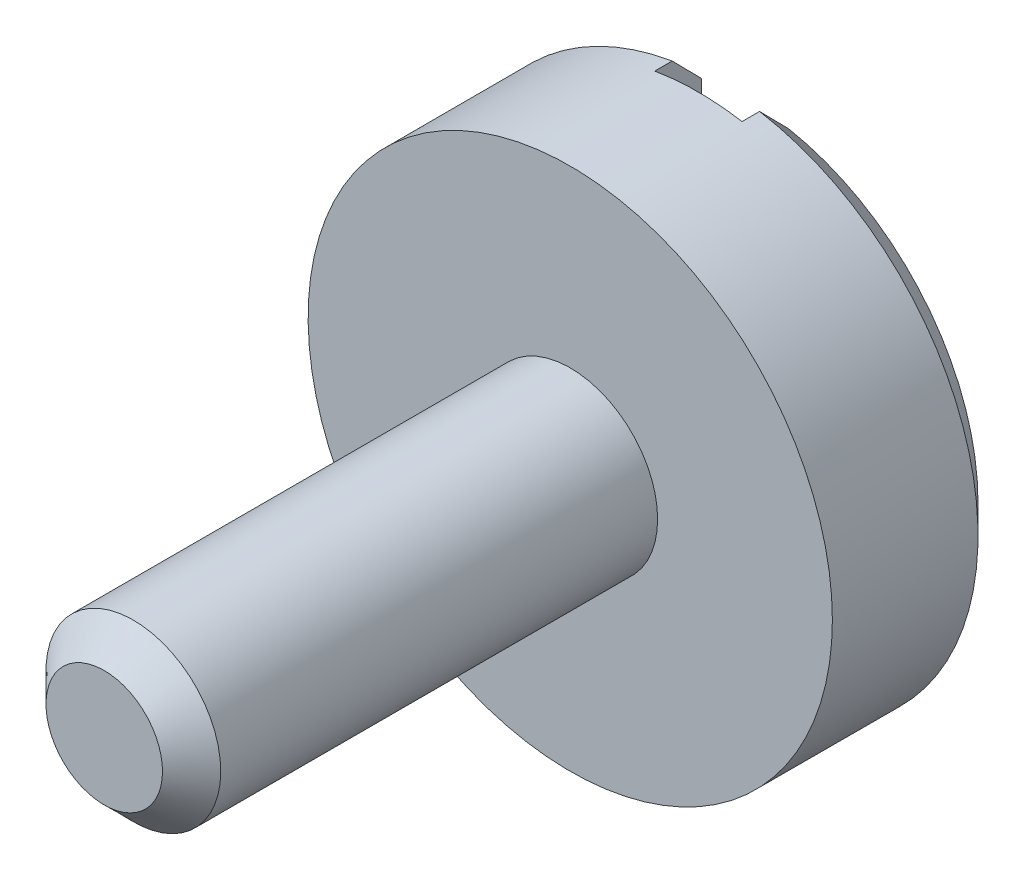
ISO-10303-21;
HEADER;
FILE_DESCRIPTION(('STEP AP214'),'2;1');
FILE_NAME('part.step','',(''),(''),'','','');
FILE_SCHEMA(('AUTOMOTIVE_DESIGN { 1 0 10303 214 1 1 1 1 }'));
ENDSEC;
DATA;
#1=APPLICATION_CONTEXT('core data for automotive mechanical design processes');
#2=APPLICATION_PROTOCOL_DEFINITION('international standard','automotive_design',2000,#1);
#3=PRODUCT_CONTEXT('',#1,'mechanical');
#4=PRODUCT('Part','Part','',(#3));
#5=PRODUCT_RELATED_PRODUCT_CATEGORY('part','',(#4));
#6=PRODUCT_DEFINITION_FORMATION('','',#4);
#7=PRODUCT_DEFINITION_CONTEXT('part definition',#1,'design');
#8=PRODUCT_DEFINITION('design','',#6,#7);
#9=PRODUCT_DEFINITION_SHAPE('','',#8);
#10=(LENGTH_UNIT() NAMED_UNIT(*) SI_UNIT(.MILLI.,.METRE.));
#11=(NAMED_UNIT(*) PLANE_ANGLE_UNIT() SI_UNIT($,.RADIAN.));
#12=(NAMED_UNIT(*) SI_UNIT($,.STERADIAN.) SOLID_ANGLE_UNIT());
#13=UNCERTAINTY_MEASURE_WITH_UNIT(LENGTH_MEASURE(1.E-05),#10,'distance_accuracy_value','');
#14=(GEOMETRIC_REPRESENTATION_CONTEXT(3) GLOBAL_UNCERTAINTY_ASSIGNED_CONTEXT((#13)) GLOBAL_UNIT_ASSIGNED_CONTEXT((#10,
#11,#12)) REPRESENTATION_CONTEXT('',''));
#15=CARTESIAN_POINT('',(0.,0.,0.));
#16=DIRECTION('',(0.,0.,1.));
#17=DIRECTION('',(1.,0.,0.));
#18=AXIS2_PLACEMENT_3D('',#15,#16,#17);
#19=CARTESIAN_POINT('',(0.,0.,0.));
#20=DIRECTION('',(0.,0.,1.));
#21=DIRECTION('',(1.,0.,0.));
#22=AXIS2_PLACEMENT_3D('',#19,#20,#21);
#23=PLANE('',#22);
#24=CARTESIAN_POINT('',(0.,0.,0.));
#25=DIRECTION('',(0.,0.,1.));
#26=DIRECTION('',(1.,0.,0.));
#27=AXIS2_PLACEMENT_3D('',#24,#25,#26);
#28=CIRCLE('',#27,4.);
#29=CARTESIAN_POINT('',(0.75,3.92905841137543,0.));
#30=VERTEX_POINT('',#29);
#31=CARTESIAN_POINT('',(0.75,-3.92905841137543,0.));
#32=VERTEX_POINT('',#31);
#33=EDGE_CURVE('E92',#30,#32,#28,.F.);
#34=ORIENTED_EDGE('',*,*,#33,.T.);
#35=DIRECTION('',(0.,-1.,0.));
#36=VECTOR('',#35,1.);
#37=CARTESIAN_POINT('',(0.750000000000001,4.82400000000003,0.));
#38=LINE('',#37,#36);
#39=EDGE_CURVE('E81',#30,#32,#38,.T.);
#40=ORIENTED_EDGE('',*,*,#39,.F.);
#41=EDGE_LOOP('',(#34,#40));
#42=FACE_BOUND('',#41,.T.);
#43=ADVANCED_FACE('F27',(#42),#23,.F.);
#44=CARTESIAN_POINT('',(0.,0.,0.5));
#45=DIRECTION('',(0.,0.,1.));
#46=DIRECTION('',(1.,0.,0.));
#47=AXIS2_PLACEMENT_3D('',#44,#45,#46);
#48=CONICAL_SURFACE('',#47,4.5,0.785398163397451);
#49=CARTESIAN_POINT('',(0.750000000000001,9.8801014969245,5.90852691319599));
#50=CARTESIAN_POINT('',(0.750000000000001,9.53013802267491,5.55957617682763));
#51=CARTESIAN_POINT('',(0.750000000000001,9.18012968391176,5.21067039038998));
#52=CARTESIAN_POINT('',(0.750000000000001,8.47994963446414,4.51299744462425));
#53=CARTESIAN_POINT('',(0.750000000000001,8.12977791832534,4.16423029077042));
#54=CARTESIAN_POINT('',(0.750000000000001,7.42891449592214,3.46660172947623));
#55=CARTESIAN_POINT('',(0.750000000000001,7.07822260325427,3.11774050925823));
#56=CARTESIAN_POINT('',(0.750000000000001,6.37652299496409,2.42036050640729));
#57=CARTESIAN_POINT('',(0.750000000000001,6.02551529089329,2.07184171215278));
#58=CARTESIAN_POINT('',(0.750000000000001,5.3382456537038,1.39049062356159));
#59=CARTESIAN_POINT('',(0.750000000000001,5.00200644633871,1.05763542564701));
#60=CARTESIAN_POINT('',(0.750000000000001,4.4969680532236,0.559004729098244));
#61=CARTESIAN_POINT('',(0.75,4.32849963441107,0.392894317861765));
#62=CARTESIAN_POINT('',(0.75,3.99125014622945,0.0609945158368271));
#63=CARTESIAN_POINT('',(0.75,3.82246908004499,-0.104794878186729));
#64=CARTESIAN_POINT('',(0.75,3.48454245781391,-0.435820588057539));
#65=CARTESIAN_POINT('',(0.75,3.31539714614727,-0.601057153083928));
#66=CARTESIAN_POINT('',(0.75,2.97639753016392,-0.930814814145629));
#67=CARTESIAN_POINT('',(0.75,2.80654319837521,-1.09533588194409));
#68=CARTESIAN_POINT('',(0.75,2.46572504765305,-1.42316683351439));
#69=CARTESIAN_POINT('',(0.75,2.29476144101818,-1.58647693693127));
#70=CARTESIAN_POINT('',(0.75,2.03673116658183,-1.82975198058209));
#71=CARTESIAN_POINT('',(0.75,1.95045964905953,-1.91055948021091));
#72=CARTESIAN_POINT('',(0.75,1.77714992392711,-2.07134729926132));
#73=CARTESIAN_POINT('',(0.75,1.69011173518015,-2.15132763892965));
#74=CARTESIAN_POINT('',(0.75,1.5781739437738,-2.25270808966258));
#75=CARTESIAN_POINT('',(0.75,1.55380285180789,-2.27469188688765));
#76=CARTESIAN_POINT('',(0.75,1.50495911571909,-2.31854648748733));
#77=CARTESIAN_POINT('',(0.75,1.48048647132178,-2.34041729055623));
#78=CARTESIAN_POINT('',(0.75,1.40689272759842,-2.40584164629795));
#79=CARTESIAN_POINT('',(0.75,1.35760030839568,-2.44920306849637));
#80=CARTESIAN_POINT('',(0.75,1.25806979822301,-2.53554734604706));
#81=CARTESIAN_POINT('',(0.75,1.20782748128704,-2.57852534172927));
#82=CARTESIAN_POINT('',(0.75,1.10655031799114,-2.66351443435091));
#83=CARTESIAN_POINT('',(0.75,1.05551568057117,-2.70552577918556));
#84=CARTESIAN_POINT('',(0.75,0.951926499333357,-2.78851652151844));
#85=CARTESIAN_POINT('',(0.75,0.899362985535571,-2.82948478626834));
#86=CARTESIAN_POINT('',(0.75,0.792671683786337,-2.90932497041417));
#87=CARTESIAN_POINT('',(0.75,0.738544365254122,-2.94819750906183));
#88=CARTESIAN_POINT('',(0.75,0.628343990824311,-3.02242233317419));
#89=CARTESIAN_POINT('',(0.75,0.572283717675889,-3.05779334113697));
#90=CARTESIAN_POINT('',(0.75,0.457074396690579,-3.12298205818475));
#91=CARTESIAN_POINT('',(0.75,0.397934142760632,-3.15281457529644));
#92=CARTESIAN_POINT('',(0.75,0.290865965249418,-3.19665689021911));
#93=CARTESIAN_POINT('',(0.75,0.243824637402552,-3.21275750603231));
#94=CARTESIAN_POINT('',(0.75,0.147803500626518,-3.23696114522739));
#95=CARTESIAN_POINT('',(0.75,0.0988338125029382,-3.24510130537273));
#96=CARTESIAN_POINT('',(0.75,0.0246847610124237,-3.25001161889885));
#97=CARTESIAN_POINT('',(0.75,-0.000280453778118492,-3.25041424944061));
#98=CARTESIAN_POINT('',(0.75,-0.0501267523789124,-3.24873902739));
#99=CARTESIAN_POINT('',(0.75,-0.0750078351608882,-3.24666114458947));
#100=CARTESIAN_POINT('',(0.75,-0.149305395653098,-3.23685543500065));
#101=CARTESIAN_POINT('',(0.75,-0.198267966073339,-3.22554920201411));
#102=CARTESIAN_POINT('',(0.75,-0.282094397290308,-3.1994472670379));
#103=CARTESIAN_POINT('',(0.75,-0.317476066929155,-3.1861827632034));
#104=CARTESIAN_POINT('',(0.75,-0.386977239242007,-3.15663454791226));
#105=CARTESIAN_POINT('',(0.75,-0.421095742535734,-3.14034850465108));
#106=CARTESIAN_POINT('',(0.75,-0.488327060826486,-3.1054993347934));
#107=CARTESIAN_POINT('',(0.75,-0.52143450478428,-3.08692604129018));
#108=CARTESIAN_POINT('',(0.75,-0.586663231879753,-3.0481662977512));
#109=CARTESIAN_POINT('',(0.75,-0.618784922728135,-3.02798052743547));
#110=CARTESIAN_POINT('',(0.75,-0.688343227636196,-2.98240590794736));
#111=CARTESIAN_POINT('',(0.75,-0.725612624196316,-2.95676348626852));
#112=CARTESIAN_POINT('',(0.75,-0.79927554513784,-2.9042451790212));
#113=CARTESIAN_POINT('',(0.75,-0.835668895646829,-2.87736905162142));
#114=CARTESIAN_POINT('',(0.75,-0.943875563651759,-2.7953574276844));
#115=CARTESIAN_POINT('',(0.75,-1.01466377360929,-2.7388739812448));
#116=CARTESIAN_POINT('',(0.75,-1.15468028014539,-2.62369284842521));
#117=CARTESIAN_POINT('',(0.75,-1.22390430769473,-2.56499005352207));
#118=CARTESIAN_POINT('',(0.75,-1.36116263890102,-2.44626922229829));
#119=CARTESIAN_POINT('',(0.75,-1.42919741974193,-2.38625173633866));
#120=CARTESIAN_POINT('',(0.75,-1.56459377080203,-2.26519847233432));
#121=CARTESIAN_POINT('',(0.75,-1.63195374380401,-2.20416091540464));
#122=CARTESIAN_POINT('',(0.75,-1.76609640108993,-2.08144212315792));
#123=CARTESIAN_POINT('',(0.75,-1.83287902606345,-2.01976082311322));
#124=CARTESIAN_POINT('',(0.75,-1.96590720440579,-1.89602850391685));
#125=CARTESIAN_POINT('',(0.75,-2.03215343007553,-1.83397820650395));
#126=CARTESIAN_POINT('',(0.75,-2.16431283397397,-1.70952887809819));
#127=CARTESIAN_POINT('',(0.75,-2.2302260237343,-1.64712985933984));
#128=CARTESIAN_POINT('',(0.75,-2.42635813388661,-1.46069682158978));
#129=CARTESIAN_POINT('',(0.75,-2.55620491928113,-1.33627147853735));
#130=CARTESIAN_POINT('',(0.75,-2.8152586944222,-1.08675610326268));
#131=CARTESIAN_POINT('',(0.75,-2.9444656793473,-0.961666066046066));
#132=CARTESIAN_POINT('',(0.749999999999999,-3.33145178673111,-0.585726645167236));
#133=CARTESIAN_POINT('',(0.749999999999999,-3.5885879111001,-0.334215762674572));
#134=CARTESIAN_POINT('',(0.749999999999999,-4.10213893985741,0.169857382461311));
#135=CARTESIAN_POINT('',(0.749999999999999,-4.35855329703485,0.422420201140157));
#136=CARTESIAN_POINT('',(0.749999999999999,-4.87084762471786,0.928079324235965));
#137=CARTESIAN_POINT('',(0.749999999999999,-5.12672760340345,1.18117562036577));
#138=CARTESIAN_POINT('',(0.749999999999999,-5.6375360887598,1.68709805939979));
#139=CARTESIAN_POINT('',(0.749999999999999,-5.89246540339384,1.93992338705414));
#140=CARTESIAN_POINT('',(0.749999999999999,-6.40209695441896,2.44580483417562));
#141=CARTESIAN_POINT('',(0.749999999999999,-6.65679918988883,2.69886095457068));
#142=CARTESIAN_POINT('',(0.749999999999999,-7.42058711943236,3.45818728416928));
#143=CARTESIAN_POINT('',(0.749999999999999,-7.92943546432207,3.96469621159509));
#144=CARTESIAN_POINT('',(0.749999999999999,-8.55826367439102,4.59105769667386));
#145=CARTESIAN_POINT('',(0.749999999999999,-8.67840568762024,4.71074758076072));
#146=CARTESIAN_POINT('',(0.749999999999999,-8.91867488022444,4.95014833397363));
#147=CARTESIAN_POINT('',(0.749999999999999,-9.03880205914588,5.06985920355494));
#148=CARTESIAN_POINT('',(0.749999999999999,-9.27913419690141,5.30938965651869));
#149=CARTESIAN_POINT('',(0.749999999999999,-9.39933914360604,5.42920925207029));
#150=CARTESIAN_POINT('',(0.749999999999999,-9.63973196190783,5.668859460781));
#151=CARTESIAN_POINT('',(0.749999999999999,-9.75991983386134,5.78869007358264));
#152=CARTESIAN_POINT('',(0.749999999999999,-9.8801014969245,5.90852691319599));
#153=B_SPLINE_CURVE_WITH_KNOTS('',3,(#49,#50,#51,#52,#53,#54,#55,#56,#57,#58,#59,#60,#61,#62,
#63,#64,#65,#66,#67,#68,#69,#70,#71,#72,#73,#74,#75,#76,#77,#78,#79,#80,#81,#82,#83,#84,#85,#86,
#87,#88,#89,#90,#91,#92,#93,#94,#95,#96,#97,#98,#99,#100,#101,#102,#103,#104,#105,#106,#107,
#108,#109,#110,#111,#112,#113,#114,#115,#116,#117,#118,#119,#120,#121,#122,#123,#124,#125,#126,
#127,#128,#129,#130,#131,#132,#133,#134,#135,#136,#137,#138,#139,#140,#141,#142,#143,#144,#145,
#146,#147,#148,#149,#150,#151,#152),.UNSPECIFIED.,.F.,.F.,(4,2,2,2,2,2,2,2,2,2,2,2,2,2,2,2,2,2,
2,2,2,2,2,2,2,2,2,2,2,2,2,2,2,2,2,2,2,2,2,2,2,2,2,2,2,2,2,2,2,2,2,4),(0.,1.48262253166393,
2.96529872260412,4.44927989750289,5.93320883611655,7.35258945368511,8.0623556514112,
8.77211465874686,9.48149255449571,10.1908981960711,10.9001718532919,11.2547865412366,
11.6093925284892,11.7078561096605,11.8063199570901,12.0032658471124,12.2016072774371,
12.3998972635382,12.5997954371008,12.7996342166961,12.9983391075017,13.1965048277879,
13.3452003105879,13.4931987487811,13.5679885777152,13.6427793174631,13.7926802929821,
13.9058950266,14.019197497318,14.1330231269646,14.246801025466,14.3824816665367,
14.5181890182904,14.7897913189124,15.0620622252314,15.3342212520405,15.6069184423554,
15.879643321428,16.1519452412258,16.4242376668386,16.9637484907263,17.5032633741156,
18.5823270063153,19.6620609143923,20.7417781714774,21.8188975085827,22.8960211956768,
25.0499245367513,25.5586857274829,26.0674598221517,26.5766294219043,27.0857860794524),.UNSPECIFIED.);
#154=CARTESIAN_POINT('',(0.750000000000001,4.43705983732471,0.5));
#155=VERTEX_POINT('',#154);
#156=EDGE_CURVE('E78',#155,#30,#153,.T.);
#157=ORIENTED_EDGE('',*,*,#156,.F.);
#158=CARTESIAN_POINT('',(0.,0.,0.5));
#159=DIRECTION('',(0.,0.,1.));
#160=DIRECTION('',(1.,0.,0.));
#161=AXIS2_PLACEMENT_3D('',#158,#159,#160);
#162=CIRCLE('',#161,4.5);
#163=CARTESIAN_POINT('',(0.749999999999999,-4.43705983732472,0.500000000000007));
#164=VERTEX_POINT('',#163);
#165=EDGE_CURVE('E101',#164,#155,#162,.T.);
#166=ORIENTED_EDGE('',*,*,#165,.F.);
#167=EDGE_CURVE('E88',#32,#164,#153,.T.);
#168=ORIENTED_EDGE('',*,*,#167,.F.);
#169=ORIENTED_EDGE('',*,*,#33,.F.);
#170=EDGE_LOOP('',(#157,#166,#168,#169));
#171=FACE_BOUND('',#170,.T.);
#172=ADVANCED_FACE('F94',(#171),#48,.T.);
#173=CARTESIAN_POINT('',(0.,0.,3.));
#174=DIRECTION('',(0.,0.,1.));
#175=DIRECTION('',(1.,0.,0.));
#176=AXIS2_PLACEMENT_3D('',#173,#174,#175);
#177=PLANE('',#176);
#178=CARTESIAN_POINT('',(0.,0.,3.));
#179=DIRECTION('',(0.,0.,1.));
#180=DIRECTION('',(1.,0.,0.));
#181=AXIS2_PLACEMENT_3D('',#178,#179,#180);
#182=CIRCLE('',#181,4.5);
#183=CARTESIAN_POINT('',(4.5,0.,3.));
#184=VERTEX_POINT('',#183);
#185=EDGE_CURVE('E178',#184,#184,#182,.T.);
#186=ORIENTED_EDGE('',*,*,#185,.T.);
#187=EDGE_LOOP('',(#186));
#188=FACE_BOUND('',#187,.T.);
#189=CARTESIAN_POINT('',(0.,0.,3.));
#190=DIRECTION('',(0.,0.,1.));
#191=DIRECTION('',(1.,0.,0.));
#192=AXIS2_PLACEMENT_3D('',#189,#190,#191);
#193=CIRCLE('',#192,1.5);
#194=CARTESIAN_POINT('',(1.5,0.,3.));
#195=VERTEX_POINT('',#194);
#196=EDGE_CURVE('E176',#195,#195,#193,.T.);
#197=ORIENTED_EDGE('',*,*,#196,.F.);
#198=EDGE_LOOP('',(#197));
#199=FACE_BOUND('',#198,.T.);
#200=ADVANCED_FACE('F139',(#188,#199),#177,.T.);
#201=CARTESIAN_POINT('',(0.,0.,3.));
#202=DIRECTION('',(0.,0.,-1.));
#203=DIRECTION('',(-1.,0.,0.));
#204=AXIS2_PLACEMENT_3D('',#201,#202,#203);
#205=CYLINDRICAL_SURFACE('',#204,4.5);
#206=ORIENTED_EDGE('',*,*,#165,.T.);
#207=DIRECTION('',(0.,0.,-1.));
#208=VECTOR('',#207,1.);
#209=CARTESIAN_POINT('',(0.750000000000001,4.43705983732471,3.));
#210=LINE('',#209,#208);
#211=CARTESIAN_POINT('',(0.750000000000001,4.43705983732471,0.8));
#212=VERTEX_POINT('',#211);
#213=EDGE_CURVE('E50',#155,#212,#210,.F.);
#214=ORIENTED_EDGE('',*,*,#213,.T.);
#215=CARTESIAN_POINT('',(0.,0.,0.8));
#216=DIRECTION('',(0.,0.,-1.));
#217=DIRECTION('',(-1.,0.,0.));
#218=AXIS2_PLACEMENT_3D('',#215,#216,#217);
#219=CIRCLE('',#218,4.5);
#220=CARTESIAN_POINT('',(-0.749999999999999,4.43705983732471,0.8));
#221=VERTEX_POINT('',#220);
#222=EDGE_CURVE('E163',#221,#212,#219,.T.);
#223=ORIENTED_EDGE('',*,*,#222,.F.);
#224=DIRECTION('',(0.,0.,-1.));
#225=VECTOR('',#224,1.);
#226=CARTESIAN_POINT('',(-0.749999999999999,4.43705983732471,3.));
#227=LINE('',#226,#225);
#228=CARTESIAN_POINT('',(-0.749999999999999,4.43705983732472,0.500000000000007));
#229=VERTEX_POINT('',#228);
#230=EDGE_CURVE('E158',#221,#229,#227,.T.);
#231=ORIENTED_EDGE('',*,*,#230,.T.);
#232=CARTESIAN_POINT('',(-0.750000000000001,-4.43705983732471,0.5));
#233=VERTEX_POINT('',#232);
#234=EDGE_CURVE('E96',#229,#233,#162,.T.);
#235=ORIENTED_EDGE('',*,*,#234,.T.);
#236=DIRECTION('',(0.,0.,-1.));
#237=VECTOR('',#236,1.);
#238=CARTESIAN_POINT('',(-0.750000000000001,-4.43705983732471,3.));
#239=LINE('',#238,#237);
#240=CARTESIAN_POINT('',(-0.750000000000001,-4.43705983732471,0.8));
#241=VERTEX_POINT('',#240);
#242=EDGE_CURVE('E164',#233,#241,#239,.F.);
#243=ORIENTED_EDGE('',*,*,#242,.T.);
#244=CARTESIAN_POINT('',(0.749999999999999,-4.43705983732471,0.8));
#245=VERTEX_POINT('',#244);
#246=EDGE_CURVE('E87',#245,#241,#219,.T.);
#247=ORIENTED_EDGE('',*,*,#246,.F.);
#248=DIRECTION('',(0.,0.,-1.));
#249=VECTOR('',#248,1.);
#250=CARTESIAN_POINT('',(0.749999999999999,-4.43705983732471,3.));
#251=LINE('',#250,#249);
#252=EDGE_CURVE('E167',#245,#164,#251,.T.);
#253=ORIENTED_EDGE('',*,*,#252,.T.);
#254=EDGE_LOOP('',(#206,#214,#223,#231,#235,#243,#247,#253));
#255=FACE_BOUND('',#254,.T.);
#256=ORIENTED_EDGE('',*,*,#185,.F.);
#257=EDGE_LOOP('',(#256));
#258=FACE_BOUND('',#257,.T.);
#259=ADVANCED_FACE('F29',(#255,#258),#205,.T.);
#260=CARTESIAN_POINT('',(-0.750000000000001,-3.92905841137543,0.));
#261=VERTEX_POINT('',#260);
#262=CARTESIAN_POINT('',(-0.749999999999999,3.92905841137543,0.));
#263=VERTEX_POINT('',#262);
#264=EDGE_CURVE('E95',#261,#263,#28,.F.);
#265=ORIENTED_EDGE('',*,*,#264,.T.);
#266=DIRECTION('',(0.,1.,0.));
#267=VECTOR('',#266,1.);
#268=CARTESIAN_POINT('',(-0.749999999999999,4.82400000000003,0.));
#269=LINE('',#268,#267);
#270=EDGE_CURVE('E42',#261,#263,#269,.T.);
#271=ORIENTED_EDGE('',*,*,#270,.F.);
#272=EDGE_LOOP('',(#265,#271));
#273=FACE_BOUND('',#272,.T.);
#274=ADVANCED_FACE('F134',(#273),#23,.F.);
#275=CARTESIAN_POINT('',(0.,0.,11.));
#276=DIRECTION('',(0.,0.,-1.));
#277=DIRECTION('',(-1.,0.,0.));
#278=AXIS2_PLACEMENT_3D('',#275,#276,#277);
#279=CYLINDRICAL_SURFACE('',#278,1.5);
#280=CARTESIAN_POINT('',(0.,0.,10.5));
#281=DIRECTION('',(0.,0.,1.));
#282=DIRECTION('',(1.,0.,0.));
#283=AXIS2_PLACEMENT_3D('',#280,#281,#282);
#284=CIRCLE('',#283,1.5);
#285=CARTESIAN_POINT('',(1.5,0.,10.5));
#286=VERTEX_POINT('',#285);
#287=EDGE_CURVE('E11',#286,#286,#284,.F.);
#288=ORIENTED_EDGE('',*,*,#287,.T.);
#289=EDGE_LOOP('',(#288));
#290=FACE_BOUND('',#289,.T.);
#291=ORIENTED_EDGE('',*,*,#196,.T.);
#292=EDGE_LOOP('',(#291));
#293=FACE_BOUND('',#292,.T.);
#294=ADVANCED_FACE('F142',(#290,#293),#279,.T.);
#295=CARTESIAN_POINT('',(0.,0.,11.));
#296=DIRECTION('',(0.,0.,1.));
#297=DIRECTION('',(1.,0.,0.));
#298=AXIS2_PLACEMENT_3D('',#295,#296,#297);
#299=PLANE('',#298);
#300=CARTESIAN_POINT('',(0.,0.,11.));
#301=DIRECTION('',(0.,0.,1.));
#302=DIRECTION('',(1.,0.,0.));
#303=AXIS2_PLACEMENT_3D('',#300,#301,#302);
#304=CIRCLE('',#303,1.);
#305=CARTESIAN_POINT('',(1.,0.,11.));
#306=VERTEX_POINT('',#305);
#307=EDGE_CURVE('E35',#306,#306,#304,.T.);
#308=ORIENTED_EDGE('',*,*,#307,.T.);
#309=EDGE_LOOP('',(#308));
#310=FACE_BOUND('',#309,.T.);
#311=ADVANCED_FACE('F149',(#310),#299,.T.);
#312=CARTESIAN_POINT('',(-0.750000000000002,-9.8801014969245,5.90852691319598));
#313=CARTESIAN_POINT('',(-0.750000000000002,-9.53013802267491,5.55957617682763));
#314=CARTESIAN_POINT('',(-0.750000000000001,-9.18012968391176,5.21067039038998));
#315=CARTESIAN_POINT('',(-0.750000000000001,-8.47994963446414,4.51299744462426));
#316=CARTESIAN_POINT('',(-0.750000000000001,-8.12977791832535,4.16423029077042));
#317=CARTESIAN_POINT('',(-0.750000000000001,-7.42891449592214,3.46660172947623));
#318=CARTESIAN_POINT('',(-0.750000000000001,-7.07822260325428,3.11774050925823));
#319=CARTESIAN_POINT('',(-0.750000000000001,-6.37652299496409,2.4203605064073));
#320=CARTESIAN_POINT('',(-0.750000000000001,-6.0255152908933,2.07184171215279));
#321=CARTESIAN_POINT('',(-0.750000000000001,-5.33824565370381,1.39049062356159));
#322=CARTESIAN_POINT('',(-0.750000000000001,-5.00200644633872,1.05763542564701));
#323=CARTESIAN_POINT('',(-0.750000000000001,-4.4969680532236,0.559004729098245));
#324=CARTESIAN_POINT('',(-0.750000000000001,-4.32849963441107,0.392894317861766));
#325=CARTESIAN_POINT('',(-0.750000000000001,-3.99125014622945,0.0609945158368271));
#326=CARTESIAN_POINT('',(-0.750000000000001,-3.82246908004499,-0.104794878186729));
#327=CARTESIAN_POINT('',(-0.750000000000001,-3.48454245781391,-0.435820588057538));
#328=CARTESIAN_POINT('',(-0.750000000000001,-3.31539714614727,-0.601057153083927));
#329=CARTESIAN_POINT('',(-0.750000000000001,-2.97639753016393,-0.930814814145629));
#330=CARTESIAN_POINT('',(-0.750000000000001,-2.80654319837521,-1.09533588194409));
#331=CARTESIAN_POINT('',(-0.750000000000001,-2.46572504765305,-1.42316683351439));
#332=CARTESIAN_POINT('',(-0.75,-2.29476144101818,-1.58647693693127));
#333=CARTESIAN_POINT('',(-0.75,-2.03673116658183,-1.82975198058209));
#334=CARTESIAN_POINT('',(-0.75,-1.95045964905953,-1.91055948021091));
#335=CARTESIAN_POINT('',(-0.75,-1.77714992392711,-2.07134729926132));
#336=CARTESIAN_POINT('',(-0.75,-1.69011173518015,-2.15132763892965));
#337=CARTESIAN_POINT('',(-0.75,-1.5781739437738,-2.25270808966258));
#338=CARTESIAN_POINT('',(-0.75,-1.55380285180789,-2.27469188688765));
#339=CARTESIAN_POINT('',(-0.75,-1.50495911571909,-2.31854648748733));
#340=CARTESIAN_POINT('',(-0.75,-1.48048647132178,-2.34041729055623));
#341=CARTESIAN_POINT('',(-0.75,-1.40689272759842,-2.40584164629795));
#342=CARTESIAN_POINT('',(-0.75,-1.35760030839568,-2.44920306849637));
#343=CARTESIAN_POINT('',(-0.75,-1.25806979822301,-2.53554734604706));
#344=CARTESIAN_POINT('',(-0.75,-1.20782748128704,-2.57852534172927));
#345=CARTESIAN_POINT('',(-0.75,-1.10655031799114,-2.66351443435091));
#346=CARTESIAN_POINT('',(-0.75,-1.05551568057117,-2.70552577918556));
#347=CARTESIAN_POINT('',(-0.75,-0.951926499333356,-2.78851652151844));
#348=CARTESIAN_POINT('',(-0.75,-0.899362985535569,-2.82948478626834));
#349=CARTESIAN_POINT('',(-0.75,-0.792671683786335,-2.90932497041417));
#350=CARTESIAN_POINT('',(-0.75,-0.73854436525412,-2.94819750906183));
#351=CARTESIAN_POINT('',(-0.75,-0.62834399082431,-3.02242233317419));
#352=CARTESIAN_POINT('',(-0.75,-0.572283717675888,-3.05779334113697));
#353=CARTESIAN_POINT('',(-0.75,-0.457074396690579,-3.12298205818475));
#354=CARTESIAN_POINT('',(-0.75,-0.397934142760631,-3.15281457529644));
#355=CARTESIAN_POINT('',(-0.75,-0.290865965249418,-3.19665689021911));
#356=CARTESIAN_POINT('',(-0.75,-0.243824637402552,-3.21275750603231));
#357=CARTESIAN_POINT('',(-0.75,-0.147803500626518,-3.23696114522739));
#358=CARTESIAN_POINT('',(-0.75,-0.0988338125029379,-3.24510130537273));
#359=CARTESIAN_POINT('',(-0.75,-0.0246847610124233,-3.25001161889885));
#360=CARTESIAN_POINT('',(-0.75,0.000280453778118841,-3.25041424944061));
#361=CARTESIAN_POINT('',(-0.75,0.0501267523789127,-3.24873902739));
#362=CARTESIAN_POINT('',(-0.75,0.0750078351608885,-3.24666114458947));
#363=CARTESIAN_POINT('',(-0.75,0.149305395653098,-3.23685543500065));
#364=CARTESIAN_POINT('',(-0.75,0.198267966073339,-3.22554920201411));
#365=CARTESIAN_POINT('',(-0.75,0.282094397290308,-3.1994472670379));
#366=CARTESIAN_POINT('',(-0.75,0.317476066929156,-3.1861827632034));
#367=CARTESIAN_POINT('',(-0.75,0.386977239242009,-3.15663454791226));
#368=CARTESIAN_POINT('',(-0.75,0.421095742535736,-3.14034850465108));
#369=CARTESIAN_POINT('',(-0.75,0.488327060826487,-3.1054993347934));
#370=CARTESIAN_POINT('',(-0.75,0.52143450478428,-3.08692604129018));
#371=CARTESIAN_POINT('',(-0.75,0.586663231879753,-3.0481662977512));
#372=CARTESIAN_POINT('',(-0.75,0.618784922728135,-3.02798052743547));
#373=CARTESIAN_POINT('',(-0.75,0.688343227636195,-2.98240590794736));
#374=CARTESIAN_POINT('',(-0.75,0.725612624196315,-2.95676348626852));
#375=CARTESIAN_POINT('',(-0.75,0.799275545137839,-2.9042451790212));
#376=CARTESIAN_POINT('',(-0.75,0.835668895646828,-2.87736905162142));
#377=CARTESIAN_POINT('',(-0.75,0.943875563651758,-2.7953574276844));
#378=CARTESIAN_POINT('',(-0.75,1.01466377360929,-2.7388739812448));
#379=CARTESIAN_POINT('',(-0.75,1.15468028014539,-2.62369284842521));
#380=CARTESIAN_POINT('',(-0.75,1.22390430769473,-2.56499005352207));
#381=CARTESIAN_POINT('',(-0.75,1.36116263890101,-2.44626922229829));
#382=CARTESIAN_POINT('',(-0.75,1.42919741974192,-2.38625173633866));
#383=CARTESIAN_POINT('',(-0.75,1.56459377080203,-2.26519847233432));
#384=CARTESIAN_POINT('',(-0.75,1.631953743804,-2.20416091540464));
#385=CARTESIAN_POINT('',(-0.75,1.76609640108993,-2.08144212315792));
#386=CARTESIAN_POINT('',(-0.75,1.83287902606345,-2.01976082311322));
#387=CARTESIAN_POINT('',(-0.75,1.96590720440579,-1.89602850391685));
#388=CARTESIAN_POINT('',(-0.75,2.03215343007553,-1.83397820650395));
#389=CARTESIAN_POINT('',(-0.75,2.16431283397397,-1.70952887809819));
#390=CARTESIAN_POINT('',(-0.75,2.2302260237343,-1.64712985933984));
#391=CARTESIAN_POINT('',(-0.75,2.42635813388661,-1.46069682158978));
#392=CARTESIAN_POINT('',(-0.75,2.55620491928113,-1.33627147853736));
#393=CARTESIAN_POINT('',(-0.75,2.8152586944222,-1.08675610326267));
#394=CARTESIAN_POINT('',(-0.75,2.9444656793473,-0.961666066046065));
#395=CARTESIAN_POINT('',(-0.749999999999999,3.33145178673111,-0.585726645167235));
#396=CARTESIAN_POINT('',(-0.749999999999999,3.5885879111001,-0.334215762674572));
#397=CARTESIAN_POINT('',(-0.749999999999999,4.10213893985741,0.16985738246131));
#398=CARTESIAN_POINT('',(-0.749999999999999,4.35855329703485,0.422420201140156));
#399=CARTESIAN_POINT('',(-0.749999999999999,4.87084762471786,0.928079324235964));
#400=CARTESIAN_POINT('',(-0.749999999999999,5.12672760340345,1.18117562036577));
#401=CARTESIAN_POINT('',(-0.749999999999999,5.6375360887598,1.68709805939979));
#402=CARTESIAN_POINT('',(-0.749999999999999,5.89246540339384,1.93992338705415));
#403=CARTESIAN_POINT('',(-0.749999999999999,6.40209695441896,2.44580483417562));
#404=CARTESIAN_POINT('',(-0.749999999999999,6.65679918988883,2.69886095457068));
#405=CARTESIAN_POINT('',(-0.749999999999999,7.42058711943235,3.45818728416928));
#406=CARTESIAN_POINT('',(-0.749999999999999,7.92943546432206,3.96469621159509));
#407=CARTESIAN_POINT('',(-0.749999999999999,8.55826367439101,4.59105769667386));
#408=CARTESIAN_POINT('',(-0.749999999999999,8.67840568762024,4.71074758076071));
#409=CARTESIAN_POINT('',(-0.749999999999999,8.91867488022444,4.95014833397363));
#410=CARTESIAN_POINT('',(-0.749999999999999,9.03880205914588,5.06985920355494));
#411=CARTESIAN_POINT('',(-0.749999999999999,9.27913419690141,5.30938965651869));
#412=CARTESIAN_POINT('',(-0.749999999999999,9.39933914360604,5.42920925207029));
#413=CARTESIAN_POINT('',(-0.749999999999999,9.63973196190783,5.668859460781));
#414=CARTESIAN_POINT('',(-0.749999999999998,9.75991983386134,5.78869007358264));
#415=CARTESIAN_POINT('',(-0.749999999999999,9.8801014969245,5.90852691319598));
#416=B_SPLINE_CURVE_WITH_KNOTS('',3,(#312,#313,#314,#315,#316,#317,#318,#319,#320,#321,#322,
#323,#324,#325,#326,#327,#328,#329,#330,#331,#332,#333,#334,#335,#336,#337,#338,#339,#340,#341,
#342,#343,#344,#345,#346,#347,#348,#349,#350,#351,#352,#353,#354,#355,#356,#357,#358,#359,#360,
#361,#362,#363,#364,#365,#366,#367,#368,#369,#370,#371,#372,#373,#374,#375,#376,#377,#378,#379,
#380,#381,#382,#383,#384,#385,#386,#387,#388,#389,#390,#391,#392,#393,#394,#395,#396,#397,#398,
#399,#400,#401,#402,#403,#404,#405,#406,#407,#408,#409,#410,#411,#412,#413,#414,#415),
.UNSPECIFIED.,.F.,.F.,(4,2,2,2,2,2,2,2,2,2,2,2,2,2,2,2,2,2,2,2,2,2,2,2,2,2,2,2,2,2,2,2,2,2,2,2,
2,2,2,2,2,2,2,2,2,2,2,2,2,2,2,4),(0.,1.48262253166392,2.96529872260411,4.44927989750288,
5.93320883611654,7.35258945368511,8.0623556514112,8.77211465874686,9.4814925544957,
10.1908981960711,10.9001718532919,11.2547865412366,11.6093925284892,11.7078561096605,
11.8063199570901,12.0032658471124,12.2016072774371,12.3998972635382,12.5997954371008,
12.7996342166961,12.9983391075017,13.1965048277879,13.3452003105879,13.4931987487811,
13.5679885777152,13.6427793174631,13.7926802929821,13.9058950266,14.019197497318,
14.1330231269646,14.246801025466,14.3824816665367,14.5181890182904,14.7897913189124,
15.0620622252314,15.3342212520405,15.6069184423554,15.879643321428,16.1519452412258,
16.4242376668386,16.9637484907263,17.5032633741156,18.5823270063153,19.6620609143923,
20.7417781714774,21.8188975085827,22.8960211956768,25.0499245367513,25.5586857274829,
26.0674598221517,26.5766294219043,27.0857860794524),.UNSPECIFIED.);
#417=EDGE_CURVE('E110',#233,#261,#416,.T.);
#418=ORIENTED_EDGE('',*,*,#417,.F.);
#419=ORIENTED_EDGE('',*,*,#234,.F.);
#420=EDGE_CURVE('E99',#263,#229,#416,.T.);
#421=ORIENTED_EDGE('',*,*,#420,.F.);
#422=ORIENTED_EDGE('',*,*,#264,.F.);
#423=EDGE_LOOP('',(#418,#419,#421,#422));
#424=FACE_BOUND('',#423,.T.);
#425=ADVANCED_FACE('F116',(#424),#48,.T.);
#426=CARTESIAN_POINT('',(0.749999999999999,-4.98399999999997,0.8));
#427=DIRECTION('',(0.,0.,-1.));
#428=DIRECTION('',(-1.,0.,0.));
#429=AXIS2_PLACEMENT_3D('',#426,#427,#428);
#430=PLANE('',#429);
#431=ORIENTED_EDGE('',*,*,#222,.T.);
#432=DIRECTION('',(0.,-1.,0.));
#433=VECTOR('',#432,1.);
#434=CARTESIAN_POINT('',(0.750000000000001,4.82400000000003,0.8));
#435=LINE('',#434,#433);
#436=EDGE_CURVE('E169',#212,#245,#435,.T.);
#437=ORIENTED_EDGE('',*,*,#436,.T.);
#438=ORIENTED_EDGE('',*,*,#246,.T.);
#439=DIRECTION('',(0.,1.,0.));
#440=VECTOR('',#439,1.);
#441=CARTESIAN_POINT('',(-0.749999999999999,4.82400000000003,0.8));
#442=LINE('',#441,#440);
#443=EDGE_CURVE('E165',#241,#221,#442,.T.);
#444=ORIENTED_EDGE('',*,*,#443,.T.);
#445=EDGE_LOOP('',(#431,#437,#438,#444));
#446=FACE_BOUND('',#445,.T.);
#447=ADVANCED_FACE('F124',(#446),#430,.T.);
#448=CARTESIAN_POINT('',(0.750000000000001,4.82400000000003,0.8));
#449=DIRECTION('',(1.,0.,0.));
#450=DIRECTION('',(0.,1.,0.));
#451=AXIS2_PLACEMENT_3D('',#448,#449,#450);
#452=PLANE('',#451);
#453=ORIENTED_EDGE('',*,*,#156,.T.);
#454=ORIENTED_EDGE('',*,*,#39,.T.);
#455=ORIENTED_EDGE('',*,*,#167,.T.);
#456=ORIENTED_EDGE('',*,*,#252,.F.);
#457=ORIENTED_EDGE('',*,*,#436,.F.);
#458=ORIENTED_EDGE('',*,*,#213,.F.);
#459=EDGE_LOOP('',(#453,#454,#455,#456,#457,#458));
#460=FACE_BOUND('',#459,.T.);
#461=ADVANCED_FACE('F80',(#460),#452,.F.);
#462=CARTESIAN_POINT('',(-0.749999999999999,4.82400000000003,0.8));
#463=DIRECTION('',(-1.,0.,0.));
#464=DIRECTION('',(0.,-1.,0.));
#465=AXIS2_PLACEMENT_3D('',#462,#463,#464);
#466=PLANE('',#465);
#467=ORIENTED_EDGE('',*,*,#417,.T.);
#468=ORIENTED_EDGE('',*,*,#270,.T.);
#469=ORIENTED_EDGE('',*,*,#420,.T.);
#470=ORIENTED_EDGE('',*,*,#230,.F.);
#471=ORIENTED_EDGE('',*,*,#443,.F.);
#472=ORIENTED_EDGE('',*,*,#242,.F.);
#473=EDGE_LOOP('',(#467,#468,#469,#470,#471,#472));
#474=FACE_BOUND('',#473,.T.);
#475=ADVANCED_FACE('F119',(#474),#466,.F.);
#476=CARTESIAN_POINT('',(0.,0.,11.));
#477=DIRECTION('',(0.,0.,-1.));
#478=DIRECTION('',(-1.,0.,0.));
#479=AXIS2_PLACEMENT_3D('',#476,#477,#478);
#480=CONICAL_SURFACE('',#479,1.,0.785398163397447);
#481=ORIENTED_EDGE('',*,*,#287,.F.);
#482=EDGE_LOOP('',(#481));
#483=FACE_BOUND('',#482,.T.);
#484=ORIENTED_EDGE('',*,*,#307,.F.);
#485=EDGE_LOOP('',(#484));
#486=FACE_BOUND('',#485,.T.);
#487=ADVANCED_FACE('F123',(#483,#486),#480,.T.);
#488=CLOSED_SHELL('',(#43,#172,#200,#259,#274,#294,#311,#425,#447,#461,#475,#487));
#489=MANIFOLD_SOLID_BREP('B2',#488);
#490=ADVANCED_BREP_SHAPE_REPRESENTATION('',(#18,#489),#14);
#491=SHAPE_DEFINITION_REPRESENTATION(#9,#490);
ENDSEC;
END-ISO-10303-21;
